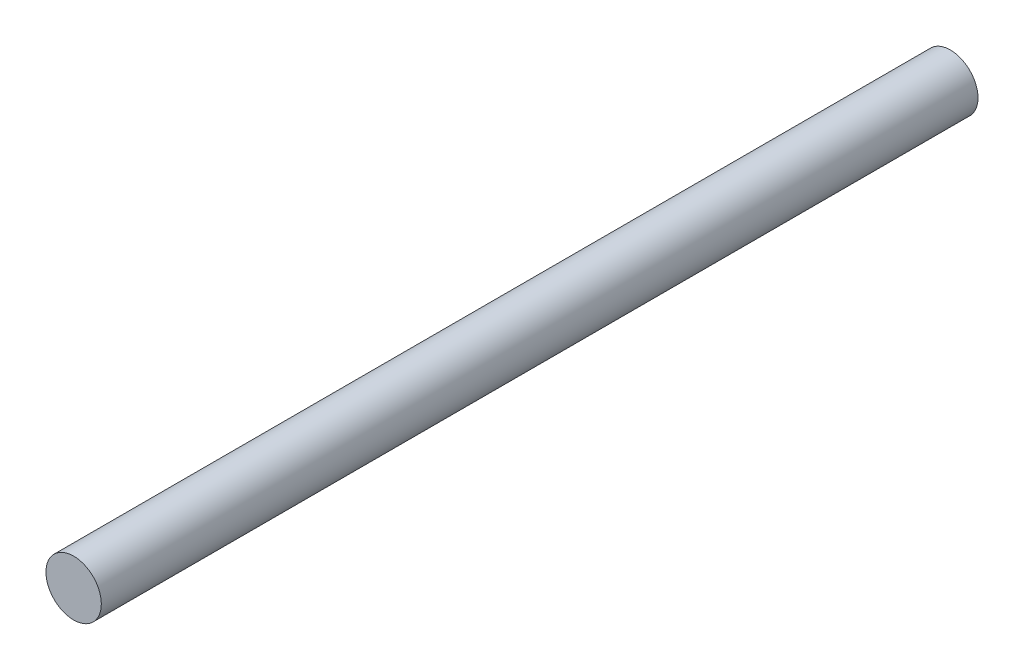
ISO-10303-21;
HEADER;
FILE_DESCRIPTION(('STEP AP214'),'2;1');
FILE_NAME('part.step','',(''),(''),'','','');
FILE_SCHEMA(('AUTOMOTIVE_DESIGN { 1 0 10303 214 1 1 1 1 }'));
ENDSEC;
DATA;
#1=APPLICATION_CONTEXT('core data for automotive mechanical design processes');
#2=APPLICATION_PROTOCOL_DEFINITION('international standard','automotive_design',2000,#1);
#3=PRODUCT_CONTEXT('',#1,'mechanical');
#4=PRODUCT('Part','Part','',(#3));
#5=PRODUCT_RELATED_PRODUCT_CATEGORY('part','',(#4));
#6=PRODUCT_DEFINITION_FORMATION('','',#4);
#7=PRODUCT_DEFINITION_CONTEXT('part definition',#1,'design');
#8=PRODUCT_DEFINITION('design','',#6,#7);
#9=PRODUCT_DEFINITION_SHAPE('','',#8);
#10=(LENGTH_UNIT() NAMED_UNIT(*) SI_UNIT(.MILLI.,.METRE.));
#11=(NAMED_UNIT(*) PLANE_ANGLE_UNIT() SI_UNIT($,.RADIAN.));
#12=(NAMED_UNIT(*) SI_UNIT($,.STERADIAN.) SOLID_ANGLE_UNIT());
#13=UNCERTAINTY_MEASURE_WITH_UNIT(LENGTH_MEASURE(1.E-05),#10,'distance_accuracy_value','');
#14=(GEOMETRIC_REPRESENTATION_CONTEXT(3) GLOBAL_UNCERTAINTY_ASSIGNED_CONTEXT((#13)) GLOBAL_UNIT_ASSIGNED_CONTEXT((#10,
#11,#12)) REPRESENTATION_CONTEXT('',''));
#15=CARTESIAN_POINT('',(0.,0.,0.));
#16=DIRECTION('',(0.,0.,1.));
#17=DIRECTION('',(1.,0.,0.));
#18=AXIS2_PLACEMENT_3D('',#15,#16,#17);
#19=CARTESIAN_POINT('',(0.,0.,-950.));
#20=DIRECTION('',(0.,0.,1.));
#21=DIRECTION('',(1.,0.,0.));
#22=AXIS2_PLACEMENT_3D('',#19,#20,#21);
#23=CYLINDRICAL_SURFACE('',#22,30.);
#24=CARTESIAN_POINT('',(0.,0.,-950.));
#25=DIRECTION('',(0.,0.,1.));
#26=DIRECTION('',(1.,0.,0.));
#27=AXIS2_PLACEMENT_3D('',#24,#25,#26);
#28=CIRCLE('',#27,30.);
#29=CARTESIAN_POINT('',(30.,0.,-950.));
#30=VERTEX_POINT('',#29);
#31=EDGE_CURVE('E10',#30,#30,#28,.T.);
#32=CARTESIAN_POINT('',(0.,0.,0.));
#33=DIRECTION('',(0.,0.,1.));
#34=DIRECTION('',(1.,0.,0.));
#35=AXIS2_PLACEMENT_3D('',#32,#33,#34);
#36=CIRCLE('',#35,30.);
#37=CARTESIAN_POINT('',(30.,0.,-1.11022302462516E-13));
#38=VERTEX_POINT('',#37);
#39=EDGE_CURVE('E40',#38,#38,#36,.T.);
#40=CARTESIAN_POINT('',(30.,0.,-950.));
#41=CARTESIAN_POINT('',(30.,0.,-940.104166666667));
#42=CARTESIAN_POINT('',(30.,0.,-930.208333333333));
#43=CARTESIAN_POINT('',(30.,0.,-910.416666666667));
#44=CARTESIAN_POINT('',(30.,0.,-900.520833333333));
#45=CARTESIAN_POINT('',(30.,0.,-880.729166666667));
#46=CARTESIAN_POINT('',(30.,0.,-870.833333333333));
#47=CARTESIAN_POINT('',(30.,0.,-851.041666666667));
#48=CARTESIAN_POINT('',(30.,0.,-841.145833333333));
#49=CARTESIAN_POINT('',(30.,0.,-821.354166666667));
#50=CARTESIAN_POINT('',(30.,0.,-811.458333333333));
#51=CARTESIAN_POINT('',(30.,0.,-791.666666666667));
#52=CARTESIAN_POINT('',(30.,0.,-781.770833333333));
#53=CARTESIAN_POINT('',(30.,0.,-761.979166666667));
#54=CARTESIAN_POINT('',(30.,0.,-752.083333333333));
#55=CARTESIAN_POINT('',(30.,0.,-732.291666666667));
#56=CARTESIAN_POINT('',(30.,0.,-722.395833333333));
#57=CARTESIAN_POINT('',(30.,0.,-702.604166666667));
#58=CARTESIAN_POINT('',(30.,0.,-692.708333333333));
#59=CARTESIAN_POINT('',(30.,0.,-672.916666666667));
#60=CARTESIAN_POINT('',(30.,0.,-663.020833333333));
#61=CARTESIAN_POINT('',(30.,0.,-643.229166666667));
#62=CARTESIAN_POINT('',(30.,0.,-633.333333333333));
#63=CARTESIAN_POINT('',(30.,0.,-613.541666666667));
#64=CARTESIAN_POINT('',(30.,0.,-603.645833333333));
#65=CARTESIAN_POINT('',(30.,0.,-583.854166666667));
#66=CARTESIAN_POINT('',(30.,0.,-573.958333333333));
#67=CARTESIAN_POINT('',(30.,0.,-554.166666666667));
#68=CARTESIAN_POINT('',(30.,0.,-544.270833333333));
#69=CARTESIAN_POINT('',(30.,0.,-524.479166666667));
#70=CARTESIAN_POINT('',(30.,0.,-514.583333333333));
#71=CARTESIAN_POINT('',(30.,0.,-494.791666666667));
#72=CARTESIAN_POINT('',(30.,0.,-484.895833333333));
#73=CARTESIAN_POINT('',(30.,0.,-465.104166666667));
#74=CARTESIAN_POINT('',(30.,0.,-455.208333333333));
#75=CARTESIAN_POINT('',(30.,0.,-435.416666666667));
#76=CARTESIAN_POINT('',(30.,0.,-425.520833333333));
#77=CARTESIAN_POINT('',(30.,0.,-405.729166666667));
#78=CARTESIAN_POINT('',(30.,0.,-395.833333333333));
#79=CARTESIAN_POINT('',(30.,0.,-376.041666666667));
#80=CARTESIAN_POINT('',(30.,0.,-366.145833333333));
#81=CARTESIAN_POINT('',(30.,0.,-346.354166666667));
#82=CARTESIAN_POINT('',(30.,0.,-336.458333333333));
#83=CARTESIAN_POINT('',(30.,0.,-316.666666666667));
#84=CARTESIAN_POINT('',(30.,0.,-306.770833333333));
#85=CARTESIAN_POINT('',(30.,0.,-286.979166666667));
#86=CARTESIAN_POINT('',(30.,0.,-277.083333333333));
#87=CARTESIAN_POINT('',(30.,0.,-257.291666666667));
#88=CARTESIAN_POINT('',(30.,0.,-247.395833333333));
#89=CARTESIAN_POINT('',(30.,0.,-227.604166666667));
#90=CARTESIAN_POINT('',(30.,0.,-217.708333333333));
#91=CARTESIAN_POINT('',(30.,0.,-197.916666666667));
#92=CARTESIAN_POINT('',(30.,0.,-188.020833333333));
#93=CARTESIAN_POINT('',(30.,0.,-168.229166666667));
#94=CARTESIAN_POINT('',(30.,0.,-158.333333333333));
#95=CARTESIAN_POINT('',(30.,0.,-138.541666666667));
#96=CARTESIAN_POINT('',(30.,0.,-128.645833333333));
#97=CARTESIAN_POINT('',(30.,0.,-108.854166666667));
#98=CARTESIAN_POINT('',(30.,0.,-98.9583333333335));
#99=CARTESIAN_POINT('',(30.,0.,-79.1666666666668));
#100=CARTESIAN_POINT('',(30.,0.,-69.2708333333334));
#101=CARTESIAN_POINT('',(30.,0.,-49.4791666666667));
#102=CARTESIAN_POINT('',(30.,0.,-39.5833333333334));
#103=CARTESIAN_POINT('',(30.,0.,-19.7916666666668));
#104=CARTESIAN_POINT('',(30.,0.,-9.89583333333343));
#105=CARTESIAN_POINT('',(30.,0.,-1.11022302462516E-13));
#106=B_SPLINE_CURVE_WITH_KNOTS('',3,(#40,#41,#42,#43,#44,#45,#46,#47,#48,#49,#50,#51,#52,#53,
#54,#55,#56,#57,#58,#59,#60,#61,#62,#63,#64,#65,#66,#67,#68,#69,#70,#71,#72,#73,#74,#75,#76,#77,
#78,#79,#80,#81,#82,#83,#84,#85,#86,#87,#88,#89,#90,#91,#92,#93,#94,#95,#96,#97,#98,#99,#100,
#101,#102,#103,#104,#105),.UNSPECIFIED.,.F.,.F.,(4,2,2,2,2,2,2,2,2,2,2,2,2,2,2,2,2,2,2,2,2,2,2,
2,2,2,2,2,2,2,2,2,4),(0.,29.6875,59.375,89.0624999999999,118.75,148.4375,178.125,207.8125,237.5,
267.1875,296.875,326.5625,356.25,385.9375,415.625,445.3125,475.,504.6875,534.375,564.0625,
593.75,623.4375,653.125,682.8125,712.5,742.1875,771.875,801.5625,831.25,860.9375,890.625,
920.3125,950.),.UNSPECIFIED.);
#107=EDGE_CURVE('BSEAM37',#30,#38,#106,.T.);
#108=ORIENTED_EDGE('',*,*,#31,.T.);
#109=ORIENTED_EDGE('',*,*,#39,.F.);
#110=ORIENTED_EDGE('',*,*,#107,.T.);
#111=ORIENTED_EDGE('',*,*,#107,.F.);
#112=EDGE_LOOP('',(#108,#110,#109,#111));
#113=FACE_BOUND('',#112,.T.);
#114=ADVANCED_FACE('F37',(#113),#23,.T.);
#115=CARTESIAN_POINT('',(0.,0.,-950.));
#116=DIRECTION('',(0.,0.,1.));
#117=DIRECTION('',(1.,0.,0.));
#118=AXIS2_PLACEMENT_3D('',#115,#116,#117);
#119=PLANE('',#118);
#120=ORIENTED_EDGE('',*,*,#31,.F.);
#121=EDGE_LOOP('',(#120));
#122=FACE_BOUND('',#121,.T.);
#123=ADVANCED_FACE('F54',(#122),#119,.F.);
#124=CARTESIAN_POINT('',(0.,0.,0.));
#125=DIRECTION('',(0.,0.,1.));
#126=DIRECTION('',(1.,0.,0.));
#127=AXIS2_PLACEMENT_3D('',#124,#125,#126);
#128=PLANE('',#127);
#129=ORIENTED_EDGE('',*,*,#39,.T.);
#130=EDGE_LOOP('',(#129));
#131=FACE_BOUND('',#130,.T.);
#132=ADVANCED_FACE('F51',(#131),#128,.T.);
#133=CLOSED_SHELL('',(#114,#123,#132));
#134=MANIFOLD_SOLID_BREP('B2',#133);
#135=ADVANCED_BREP_SHAPE_REPRESENTATION('',(#18,#134),#14);
#136=SHAPE_DEFINITION_REPRESENTATION(#9,#135);
ENDSEC;
END-ISO-10303-21;
